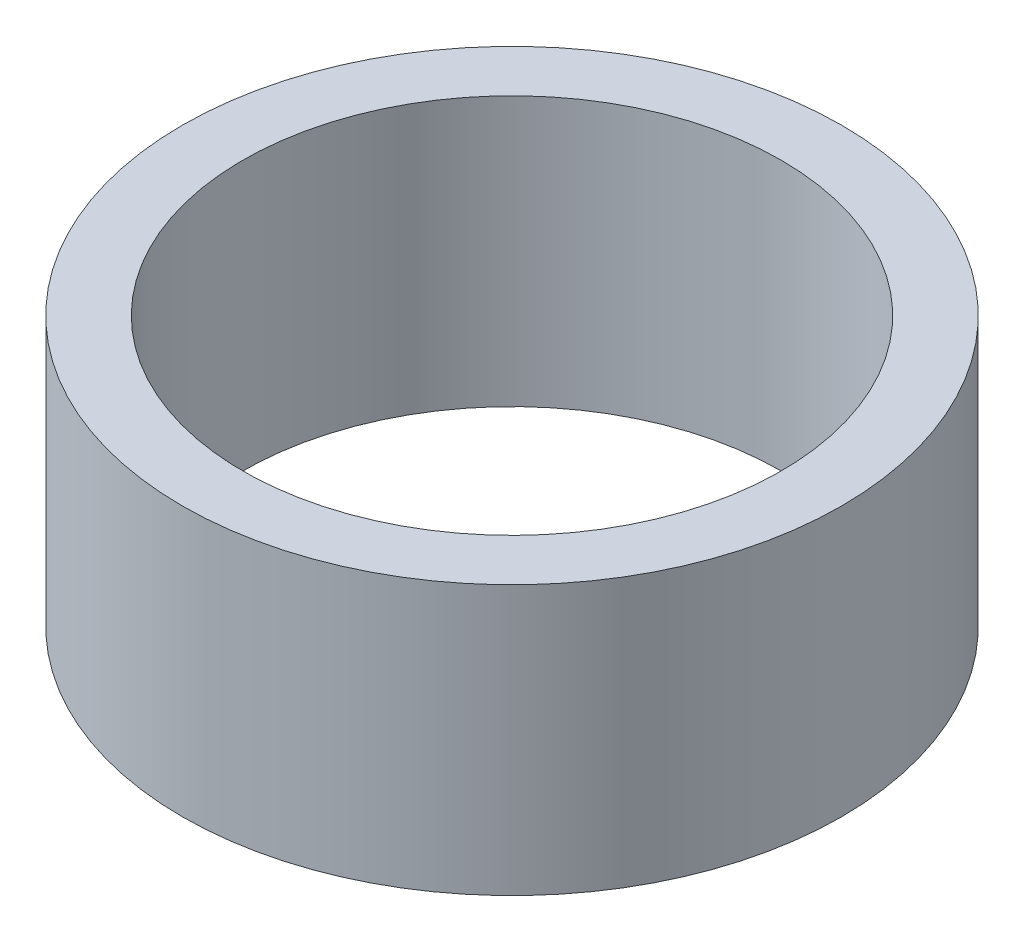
ISO-10303-21;
HEADER;
FILE_DESCRIPTION(('STEP AP214'),'2;1');
FILE_NAME('part.step','',(''),(''),'','','');
FILE_SCHEMA(('AUTOMOTIVE_DESIGN { 1 0 10303 214 1 1 1 1 }'));
ENDSEC;
DATA;
#1=APPLICATION_CONTEXT('core data for automotive mechanical design processes');
#2=APPLICATION_PROTOCOL_DEFINITION('international standard','automotive_design',2000,#1);
#3=PRODUCT_CONTEXT('',#1,'mechanical');
#4=PRODUCT('Part','Part','',(#3));
#5=PRODUCT_RELATED_PRODUCT_CATEGORY('part','',(#4));
#6=PRODUCT_DEFINITION_FORMATION('','',#4);
#7=PRODUCT_DEFINITION_CONTEXT('part definition',#1,'design');
#8=PRODUCT_DEFINITION('design','',#6,#7);
#9=PRODUCT_DEFINITION_SHAPE('','',#8);
#10=(LENGTH_UNIT() NAMED_UNIT(*) SI_UNIT(.MILLI.,.METRE.));
#11=(NAMED_UNIT(*) PLANE_ANGLE_UNIT() SI_UNIT($,.RADIAN.));
#12=(NAMED_UNIT(*) SI_UNIT($,.STERADIAN.) SOLID_ANGLE_UNIT());
#13=UNCERTAINTY_MEASURE_WITH_UNIT(LENGTH_MEASURE(1.E-05),#10,'distance_accuracy_value','');
#14=(GEOMETRIC_REPRESENTATION_CONTEXT(3) GLOBAL_UNCERTAINTY_ASSIGNED_CONTEXT((#13)) GLOBAL_UNIT_ASSIGNED_CONTEXT((#10,
#11,#12)) REPRESENTATION_CONTEXT('',''));
#15=CARTESIAN_POINT('',(0.,0.,0.));
#16=DIRECTION('',(0.,0.,1.));
#17=DIRECTION('',(1.,0.,0.));
#18=AXIS2_PLACEMENT_3D('',#15,#16,#17);
#19=CARTESIAN_POINT('',(0.,28.2575,0.));
#20=DIRECTION('',(0.,1.,0.));
#21=DIRECTION('',(0.,0.,1.));
#22=AXIS2_PLACEMENT_3D('',#19,#20,#21);
#23=PLANE('',#22);
#24=CARTESIAN_POINT('',(0.,28.2575,0.));
#25=DIRECTION('',(0.,1.,0.));
#26=DIRECTION('',(0.,0.,1.));
#27=AXIS2_PLACEMENT_3D('',#24,#25,#26);
#28=CIRCLE('',#27,34.6075);
#29=CARTESIAN_POINT('',(0.,28.2575,-34.6075));
#30=VERTEX_POINT('',#29);
#31=EDGE_CURVE('E10',#30,#30,#28,.T.);
#32=ORIENTED_EDGE('',*,*,#31,.T.);
#33=EDGE_LOOP('',(#32));
#34=FACE_BOUND('',#33,.T.);
#35=CARTESIAN_POINT('',(0.,28.2575,0.));
#36=DIRECTION('',(0.,1.,0.));
#37=DIRECTION('',(0.,0.,1.));
#38=AXIS2_PLACEMENT_3D('',#35,#36,#37);
#39=CIRCLE('',#38,28.2575);
#40=CARTESIAN_POINT('',(0.,28.2575,-28.2575));
#41=VERTEX_POINT('',#40);
#42=EDGE_CURVE('E58',#41,#41,#39,.T.);
#43=ORIENTED_EDGE('',*,*,#42,.F.);
#44=EDGE_LOOP('',(#43));
#45=FACE_BOUND('',#44,.T.);
#46=ADVANCED_FACE('F45',(#34,#45),#23,.T.);
#47=CARTESIAN_POINT('',(0.,0.,0.));
#48=DIRECTION('',(0.,1.,0.));
#49=DIRECTION('',(0.,0.,1.));
#50=AXIS2_PLACEMENT_3D('',#47,#48,#49);
#51=PLANE('',#50);
#52=CARTESIAN_POINT('',(0.,0.,0.));
#53=DIRECTION('',(0.,1.,0.));
#54=DIRECTION('',(0.,0.,1.));
#55=AXIS2_PLACEMENT_3D('',#52,#53,#54);
#56=CIRCLE('',#55,34.6075);
#57=CARTESIAN_POINT('',(0.,0.,-34.6075));
#58=VERTEX_POINT('',#57);
#59=EDGE_CURVE('E49',#58,#58,#56,.T.);
#60=ORIENTED_EDGE('',*,*,#59,.F.);
#61=EDGE_LOOP('',(#60));
#62=FACE_BOUND('',#61,.T.);
#63=CARTESIAN_POINT('',(0.,0.,0.));
#64=DIRECTION('',(0.,1.,0.));
#65=DIRECTION('',(0.,0.,1.));
#66=AXIS2_PLACEMENT_3D('',#63,#64,#65);
#67=CIRCLE('',#66,28.2575);
#68=CARTESIAN_POINT('',(0.,0.,-28.2575));
#69=VERTEX_POINT('',#68);
#70=EDGE_CURVE('E60',#69,#69,#67,.T.);
#71=ORIENTED_EDGE('',*,*,#70,.T.);
#72=EDGE_LOOP('',(#71));
#73=FACE_BOUND('',#72,.T.);
#74=ADVANCED_FACE('F72',(#62,#73),#51,.F.);
#75=CARTESIAN_POINT('',(0.,28.2575,0.));
#76=DIRECTION('',(0.,-1.,0.));
#77=DIRECTION('',(0.,0.,-1.));
#78=AXIS2_PLACEMENT_3D('',#75,#76,#77);
#79=CYLINDRICAL_SURFACE('',#78,34.6075);
#80=CARTESIAN_POINT('',(0.,28.2575,-34.6075));
#81=CARTESIAN_POINT('',(0.,27.9631510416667,-34.6075));
#82=CARTESIAN_POINT('',(0.,27.6688020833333,-34.6075));
#83=CARTESIAN_POINT('',(0.,27.0801041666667,-34.6075));
#84=CARTESIAN_POINT('',(0.,26.7857552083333,-34.6075));
#85=CARTESIAN_POINT('',(0.,26.1970572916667,-34.6075));
#86=CARTESIAN_POINT('',(0.,25.9027083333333,-34.6075));
#87=CARTESIAN_POINT('',(0.,25.3140104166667,-34.6075));
#88=CARTESIAN_POINT('',(0.,25.0196614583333,-34.6075));
#89=CARTESIAN_POINT('',(0.,24.4309635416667,-34.6075));
#90=CARTESIAN_POINT('',(0.,24.1366145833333,-34.6075));
#91=CARTESIAN_POINT('',(0.,23.5479166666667,-34.6075));
#92=CARTESIAN_POINT('',(0.,23.2535677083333,-34.6075));
#93=CARTESIAN_POINT('',(0.,22.6648697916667,-34.6075));
#94=CARTESIAN_POINT('',(0.,22.3705208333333,-34.6075));
#95=CARTESIAN_POINT('',(0.,21.7818229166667,-34.6075));
#96=CARTESIAN_POINT('',(0.,21.4874739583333,-34.6075));
#97=CARTESIAN_POINT('',(0.,20.8987760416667,-34.6075));
#98=CARTESIAN_POINT('',(0.,20.6044270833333,-34.6075));
#99=CARTESIAN_POINT('',(0.,20.0157291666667,-34.6075));
#100=CARTESIAN_POINT('',(0.,19.7213802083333,-34.6075));
#101=CARTESIAN_POINT('',(0.,19.1326822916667,-34.6075));
#102=CARTESIAN_POINT('',(0.,18.8383333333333,-34.6075));
#103=CARTESIAN_POINT('',(0.,18.2496354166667,-34.6075));
#104=CARTESIAN_POINT('',(0.,17.9552864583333,-34.6075));
#105=CARTESIAN_POINT('',(0.,17.3665885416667,-34.6075));
#106=CARTESIAN_POINT('',(0.,17.0722395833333,-34.6075));
#107=CARTESIAN_POINT('',(0.,16.4835416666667,-34.6075));
#108=CARTESIAN_POINT('',(0.,16.1891927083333,-34.6075));
#109=CARTESIAN_POINT('',(0.,15.6004947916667,-34.6075));
#110=CARTESIAN_POINT('',(0.,15.3061458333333,-34.6075));
#111=CARTESIAN_POINT('',(0.,14.7174479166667,-34.6075));
#112=CARTESIAN_POINT('',(0.,14.4230989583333,-34.6075));
#113=CARTESIAN_POINT('',(0.,13.8344010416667,-34.6075));
#114=CARTESIAN_POINT('',(0.,13.5400520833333,-34.6075));
#115=CARTESIAN_POINT('',(0.,12.9513541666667,-34.6075));
#116=CARTESIAN_POINT('',(0.,12.6570052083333,-34.6075));
#117=CARTESIAN_POINT('',(0.,12.0683072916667,-34.6075));
#118=CARTESIAN_POINT('',(0.,11.7739583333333,-34.6075));
#119=CARTESIAN_POINT('',(0.,11.1852604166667,-34.6075));
#120=CARTESIAN_POINT('',(0.,10.8909114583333,-34.6075));
#121=CARTESIAN_POINT('',(0.,10.3022135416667,-34.6075));
#122=CARTESIAN_POINT('',(0.,10.0078645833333,-34.6075));
#123=CARTESIAN_POINT('',(0.,9.41916666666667,-34.6075));
#124=CARTESIAN_POINT('',(0.,9.12481770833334,-34.6075));
#125=CARTESIAN_POINT('',(0.,8.53611979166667,-34.6075));
#126=CARTESIAN_POINT('',(0.,8.24177083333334,-34.6075));
#127=CARTESIAN_POINT('',(0.,7.65307291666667,-34.6075));
#128=CARTESIAN_POINT('',(0.,7.35872395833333,-34.6075));
#129=CARTESIAN_POINT('',(0.,6.77002604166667,-34.6075));
#130=CARTESIAN_POINT('',(0.,6.47567708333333,-34.6075));
#131=CARTESIAN_POINT('',(0.,5.88697916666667,-34.6075));
#132=CARTESIAN_POINT('',(0.,5.59263020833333,-34.6075));
#133=CARTESIAN_POINT('',(0.,5.00393229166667,-34.6075));
#134=CARTESIAN_POINT('',(0.,4.70958333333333,-34.6075));
#135=CARTESIAN_POINT('',(0.,4.12088541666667,-34.6075));
#136=CARTESIAN_POINT('',(0.,3.82653645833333,-34.6075));
#137=CARTESIAN_POINT('',(0.,3.23783854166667,-34.6075));
#138=CARTESIAN_POINT('',(0.,2.94348958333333,-34.6075));
#139=CARTESIAN_POINT('',(0.,2.35479166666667,-34.6075));
#140=CARTESIAN_POINT('',(0.,2.06044270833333,-34.6075));
#141=CARTESIAN_POINT('',(0.,1.47174479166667,-34.6075));
#142=CARTESIAN_POINT('',(0.,1.17739583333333,-34.6075));
#143=CARTESIAN_POINT('',(0.,0.588697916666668,-34.6075));
#144=CARTESIAN_POINT('',(0.,0.294348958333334,-34.6075));
#145=CARTESIAN_POINT('',(0.,0.,-34.6075));
#146=B_SPLINE_CURVE_WITH_KNOTS('',3,(#80,#81,#82,#83,#84,#85,#86,#87,#88,#89,#90,#91,#92,#93,
#94,#95,#96,#97,#98,#99,#100,#101,#102,#103,#104,#105,#106,#107,#108,#109,#110,#111,#112,#113,
#114,#115,#116,#117,#118,#119,#120,#121,#122,#123,#124,#125,#126,#127,#128,#129,#130,#131,#132,
#133,#134,#135,#136,#137,#138,#139,#140,#141,#142,#143,#144,#145),.UNSPECIFIED.,.F.,.F.,(4,2,2,
2,2,2,2,2,2,2,2,2,2,2,2,2,2,2,2,2,2,2,2,2,2,2,2,2,2,2,2,2,4),(0.,0.883046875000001,1.76609375,
2.649140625,3.5321875,4.415234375,5.29828125,6.181328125,7.064375,7.947421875,8.83046875,
9.713515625,10.5965625,11.479609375,12.36265625,13.245703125,14.12875,15.011796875,15.89484375,
16.777890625,17.6609375,18.543984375,19.42703125,20.310078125,21.193125,22.076171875,
22.95921875,23.842265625,24.7253125,25.608359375,26.49140625,27.374453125,28.2575),.UNSPECIFIED.);
#147=EDGE_CURVE('BSEAM47',#30,#58,#146,.T.);
#148=ORIENTED_EDGE('',*,*,#31,.F.);
#149=ORIENTED_EDGE('',*,*,#59,.T.);
#150=ORIENTED_EDGE('',*,*,#147,.T.);
#151=ORIENTED_EDGE('',*,*,#147,.F.);
#152=EDGE_LOOP('',(#148,#150,#149,#151));
#153=FACE_BOUND('',#152,.T.);
#154=ADVANCED_FACE('F47',(#153),#79,.T.);
#155=CARTESIAN_POINT('',(0.,28.2575,0.));
#156=DIRECTION('',(0.,-1.,0.));
#157=DIRECTION('',(0.,0.,-1.));
#158=AXIS2_PLACEMENT_3D('',#155,#156,#157);
#159=CYLINDRICAL_SURFACE('',#158,28.2575);
#160=CARTESIAN_POINT('',(0.,28.2575,-28.2575));
#161=CARTESIAN_POINT('',(0.,27.9631510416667,-28.2575));
#162=CARTESIAN_POINT('',(0.,27.6688020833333,-28.2575));
#163=CARTESIAN_POINT('',(0.,27.0801041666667,-28.2575));
#164=CARTESIAN_POINT('',(0.,26.7857552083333,-28.2575));
#165=CARTESIAN_POINT('',(0.,26.1970572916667,-28.2575));
#166=CARTESIAN_POINT('',(0.,25.9027083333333,-28.2575));
#167=CARTESIAN_POINT('',(0.,25.3140104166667,-28.2575));
#168=CARTESIAN_POINT('',(0.,25.0196614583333,-28.2575));
#169=CARTESIAN_POINT('',(0.,24.4309635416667,-28.2575));
#170=CARTESIAN_POINT('',(0.,24.1366145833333,-28.2575));
#171=CARTESIAN_POINT('',(0.,23.5479166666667,-28.2575));
#172=CARTESIAN_POINT('',(0.,23.2535677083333,-28.2575));
#173=CARTESIAN_POINT('',(0.,22.6648697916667,-28.2575));
#174=CARTESIAN_POINT('',(0.,22.3705208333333,-28.2575));
#175=CARTESIAN_POINT('',(0.,21.7818229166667,-28.2575));
#176=CARTESIAN_POINT('',(0.,21.4874739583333,-28.2575));
#177=CARTESIAN_POINT('',(0.,20.8987760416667,-28.2575));
#178=CARTESIAN_POINT('',(0.,20.6044270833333,-28.2575));
#179=CARTESIAN_POINT('',(0.,20.0157291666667,-28.2575));
#180=CARTESIAN_POINT('',(0.,19.7213802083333,-28.2575));
#181=CARTESIAN_POINT('',(0.,19.1326822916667,-28.2575));
#182=CARTESIAN_POINT('',(0.,18.8383333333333,-28.2575));
#183=CARTESIAN_POINT('',(0.,18.2496354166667,-28.2575));
#184=CARTESIAN_POINT('',(0.,17.9552864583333,-28.2575));
#185=CARTESIAN_POINT('',(0.,17.3665885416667,-28.2575));
#186=CARTESIAN_POINT('',(0.,17.0722395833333,-28.2575));
#187=CARTESIAN_POINT('',(0.,16.4835416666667,-28.2575));
#188=CARTESIAN_POINT('',(0.,16.1891927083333,-28.2575));
#189=CARTESIAN_POINT('',(0.,15.6004947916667,-28.2575));
#190=CARTESIAN_POINT('',(0.,15.3061458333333,-28.2575));
#191=CARTESIAN_POINT('',(0.,14.7174479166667,-28.2575));
#192=CARTESIAN_POINT('',(0.,14.4230989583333,-28.2575));
#193=CARTESIAN_POINT('',(0.,13.8344010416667,-28.2575));
#194=CARTESIAN_POINT('',(0.,13.5400520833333,-28.2575));
#195=CARTESIAN_POINT('',(0.,12.9513541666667,-28.2575));
#196=CARTESIAN_POINT('',(0.,12.6570052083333,-28.2575));
#197=CARTESIAN_POINT('',(0.,12.0683072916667,-28.2575));
#198=CARTESIAN_POINT('',(0.,11.7739583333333,-28.2575));
#199=CARTESIAN_POINT('',(0.,11.1852604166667,-28.2575));
#200=CARTESIAN_POINT('',(0.,10.8909114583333,-28.2575));
#201=CARTESIAN_POINT('',(0.,10.3022135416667,-28.2575));
#202=CARTESIAN_POINT('',(0.,10.0078645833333,-28.2575));
#203=CARTESIAN_POINT('',(0.,9.41916666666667,-28.2575));
#204=CARTESIAN_POINT('',(0.,9.12481770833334,-28.2575));
#205=CARTESIAN_POINT('',(0.,8.53611979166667,-28.2575));
#206=CARTESIAN_POINT('',(0.,8.24177083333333,-28.2575));
#207=CARTESIAN_POINT('',(0.,7.65307291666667,-28.2575));
#208=CARTESIAN_POINT('',(0.,7.35872395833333,-28.2575));
#209=CARTESIAN_POINT('',(0.,6.77002604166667,-28.2575));
#210=CARTESIAN_POINT('',(0.,6.47567708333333,-28.2575));
#211=CARTESIAN_POINT('',(0.,5.88697916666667,-28.2575));
#212=CARTESIAN_POINT('',(0.,5.59263020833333,-28.2575));
#213=CARTESIAN_POINT('',(0.,5.00393229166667,-28.2575));
#214=CARTESIAN_POINT('',(0.,4.70958333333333,-28.2575));
#215=CARTESIAN_POINT('',(0.,4.12088541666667,-28.2575));
#216=CARTESIAN_POINT('',(0.,3.82653645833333,-28.2575));
#217=CARTESIAN_POINT('',(0.,3.23783854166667,-28.2575));
#218=CARTESIAN_POINT('',(0.,2.94348958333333,-28.2575));
#219=CARTESIAN_POINT('',(0.,2.35479166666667,-28.2575));
#220=CARTESIAN_POINT('',(0.,2.06044270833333,-28.2575));
#221=CARTESIAN_POINT('',(0.,1.47174479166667,-28.2575));
#222=CARTESIAN_POINT('',(0.,1.17739583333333,-28.2575));
#223=CARTESIAN_POINT('',(0.,0.588697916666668,-28.2575));
#224=CARTESIAN_POINT('',(0.,0.294348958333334,-28.2575));
#225=CARTESIAN_POINT('',(0.,0.,-28.2575));
#226=B_SPLINE_CURVE_WITH_KNOTS('',3,(#160,#161,#162,#163,#164,#165,#166,#167,#168,#169,#170,
#171,#172,#173,#174,#175,#176,#177,#178,#179,#180,#181,#182,#183,#184,#185,#186,#187,#188,#189,
#190,#191,#192,#193,#194,#195,#196,#197,#198,#199,#200,#201,#202,#203,#204,#205,#206,#207,#208,
#209,#210,#211,#212,#213,#214,#215,#216,#217,#218,#219,#220,#221,#222,#223,#224,#225),
.UNSPECIFIED.,.F.,.F.,(4,2,2,2,2,2,2,2,2,2,2,2,2,2,2,2,2,2,2,2,2,2,2,2,2,2,2,2,2,2,2,2,4),(0.,
0.883046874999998,1.76609375,2.649140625,3.5321875,4.415234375,5.29828125,6.181328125,7.064375,
7.947421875,8.83046875,9.713515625,10.5965625,11.479609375,12.36265625,13.245703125,14.12875,
15.011796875,15.89484375,16.777890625,17.6609375,18.543984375,19.42703125,20.310078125,
21.193125,22.076171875,22.95921875,23.842265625,24.7253125,25.608359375,26.49140625,
27.374453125,28.2575),.UNSPECIFIED.);
#227=EDGE_CURVE('BSEAM68',#41,#69,#226,.T.);
#228=ORIENTED_EDGE('',*,*,#42,.T.);
#229=ORIENTED_EDGE('',*,*,#70,.F.);
#230=ORIENTED_EDGE('',*,*,#227,.T.);
#231=ORIENTED_EDGE('',*,*,#227,.F.);
#232=EDGE_LOOP('',(#228,#230,#229,#231));
#233=FACE_BOUND('',#232,.T.);
#234=ADVANCED_FACE('F68',(#233),#159,.F.);
#235=CLOSED_SHELL('',(#46,#74,#154,#234));
#236=MANIFOLD_SOLID_BREP('B2',#235);
#237=ADVANCED_BREP_SHAPE_REPRESENTATION('',(#18,#236),#14);
#238=SHAPE_DEFINITION_REPRESENTATION(#9,#237);
ENDSEC;
END-ISO-10303-21;
